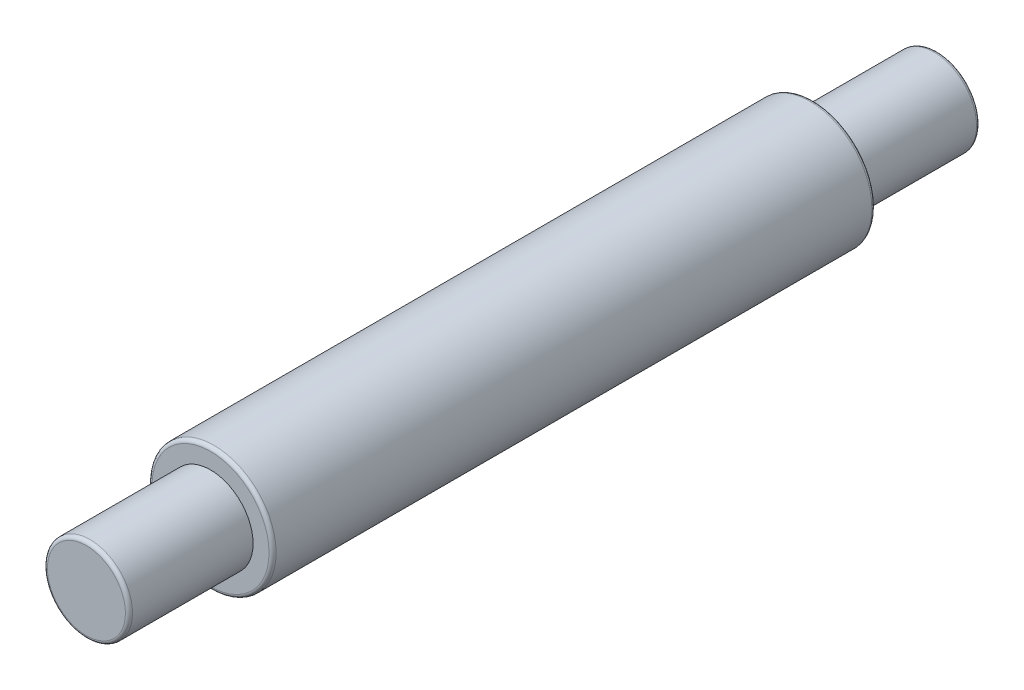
ISO-10303-21;
HEADER;
FILE_DESCRIPTION(('STEP AP214'),'2;1');
FILE_NAME('part.step','',(''),(''),'','','');
FILE_SCHEMA(('AUTOMOTIVE_DESIGN { 1 0 10303 214 1 1 1 1 }'));
ENDSEC;
DATA;
#1=APPLICATION_CONTEXT('core data for automotive mechanical design processes');
#2=APPLICATION_PROTOCOL_DEFINITION('international standard','automotive_design',2000,#1);
#3=PRODUCT_CONTEXT('',#1,'mechanical');
#4=PRODUCT('Part','Part','',(#3));
#5=PRODUCT_RELATED_PRODUCT_CATEGORY('part','',(#4));
#6=PRODUCT_DEFINITION_FORMATION('','',#4);
#7=PRODUCT_DEFINITION_CONTEXT('part definition',#1,'design');
#8=PRODUCT_DEFINITION('design','',#6,#7);
#9=PRODUCT_DEFINITION_SHAPE('','',#8);
#10=(LENGTH_UNIT() NAMED_UNIT(*) SI_UNIT(.MILLI.,.METRE.));
#11=(NAMED_UNIT(*) PLANE_ANGLE_UNIT() SI_UNIT($,.RADIAN.));
#12=(NAMED_UNIT(*) SI_UNIT($,.STERADIAN.) SOLID_ANGLE_UNIT());
#13=UNCERTAINTY_MEASURE_WITH_UNIT(LENGTH_MEASURE(1.E-05),#10,'distance_accuracy_value','');
#14=(GEOMETRIC_REPRESENTATION_CONTEXT(3) GLOBAL_UNCERTAINTY_ASSIGNED_CONTEXT((#13)) GLOBAL_UNIT_ASSIGNED_CONTEXT((#10,
#11,#12)) REPRESENTATION_CONTEXT('',''));
#15=CARTESIAN_POINT('',(0.,0.,0.));
#16=DIRECTION('',(0.,0.,1.));
#17=DIRECTION('',(1.,0.,0.));
#18=AXIS2_PLACEMENT_3D('',#15,#16,#17);
#19=CARTESIAN_POINT('',(0.,0.,120.));
#20=DIRECTION('',(0.,0.,-1.));
#21=DIRECTION('',(-1.,0.,0.));
#22=AXIS2_PLACEMENT_3D('',#19,#20,#21);
#23=CYLINDRICAL_SURFACE('',#22,12.);
#24=CARTESIAN_POINT('',(0.,0.,85.));
#25=DIRECTION('',(0.,0.,1.));
#26=DIRECTION('',(1.,0.,0.));
#27=AXIS2_PLACEMENT_3D('',#24,#25,#26);
#28=CIRCLE('',#27,12.);
#29=CARTESIAN_POINT('',(12.,0.,85.));
#30=VERTEX_POINT('',#29);
#31=EDGE_CURVE('E68',#30,#30,#28,.T.);
#32=ORIENTED_EDGE('',*,*,#31,.T.);
#33=EDGE_LOOP('',(#32));
#34=FACE_BOUND('',#33,.T.);
#35=CARTESIAN_POINT('',(0.,0.,119.));
#36=DIRECTION('',(0.,0.,1.));
#37=DIRECTION('',(1.,0.,0.));
#38=AXIS2_PLACEMENT_3D('',#35,#36,#37);
#39=CIRCLE('',#38,12.);
#40=CARTESIAN_POINT('',(12.,0.,119.));
#41=VERTEX_POINT('',#40);
#42=EDGE_CURVE('E65',#41,#41,#39,.F.);
#43=ORIENTED_EDGE('',*,*,#42,.T.);
#44=EDGE_LOOP('',(#43));
#45=FACE_BOUND('',#44,.T.);
#46=ADVANCED_FACE('F33',(#34,#45),#23,.T.);
#47=CARTESIAN_POINT('',(0.,0.,120.));
#48=DIRECTION('',(0.,0.,1.));
#49=DIRECTION('',(1.,0.,0.));
#50=AXIS2_PLACEMENT_3D('',#47,#48,#49);
#51=PLANE('',#50);
#52=CARTESIAN_POINT('',(0.,0.,120.));
#53=DIRECTION('',(0.,0.,1.));
#54=DIRECTION('',(1.,0.,0.));
#55=AXIS2_PLACEMENT_3D('',#52,#53,#54);
#56=CIRCLE('',#55,11.);
#57=CARTESIAN_POINT('',(11.,0.,120.));
#58=VERTEX_POINT('',#57);
#59=EDGE_CURVE('E56',#58,#58,#56,.T.);
#60=ORIENTED_EDGE('',*,*,#59,.T.);
#61=EDGE_LOOP('',(#60));
#62=FACE_BOUND('',#61,.T.);
#63=ADVANCED_FACE('F85',(#62),#51,.T.);
#64=CARTESIAN_POINT('',(0.,0.,119.));
#65=DIRECTION('',(0.,0.,1.));
#66=DIRECTION('',(1.,0.,0.));
#67=AXIS2_PLACEMENT_3D('',#64,#65,#66);
#68=TOROIDAL_SURFACE('',#67,11.,1.);
#69=ORIENTED_EDGE('',*,*,#42,.F.);
#70=EDGE_LOOP('',(#69));
#71=FACE_BOUND('',#70,.T.);
#72=ORIENTED_EDGE('',*,*,#59,.F.);
#73=EDGE_LOOP('',(#72));
#74=FACE_BOUND('',#73,.T.);
#75=ADVANCED_FACE('F77',(#71,#74),#68,.T.);
#76=CARTESIAN_POINT('',(0.,0.,85.));
#77=DIRECTION('',(0.,0.,1.));
#78=DIRECTION('',(1.,0.,0.));
#79=AXIS2_PLACEMENT_3D('',#76,#77,#78);
#80=PLANE('',#79);
#81=CARTESIAN_POINT('',(0.,0.,85.));
#82=DIRECTION('',(0.,0.,1.));
#83=DIRECTION('',(1.,0.,0.));
#84=AXIS2_PLACEMENT_3D('',#81,#82,#83);
#85=CIRCLE('',#84,16.5);
#86=CARTESIAN_POINT('',(16.5,0.,85.));
#87=VERTEX_POINT('',#86);
#88=EDGE_CURVE('E10',#87,#87,#85,.T.);
#89=ORIENTED_EDGE('',*,*,#88,.T.);
#90=EDGE_LOOP('',(#89));
#91=FACE_BOUND('',#90,.T.);
#92=ORIENTED_EDGE('',*,*,#31,.F.);
#93=EDGE_LOOP('',(#92));
#94=FACE_BOUND('',#93,.T.);
#95=ADVANCED_FACE('F74',(#91,#94),#80,.T.);
#96=CARTESIAN_POINT('',(0.,0.,-85.));
#97=DIRECTION('',(0.,0.,1.));
#98=DIRECTION('',(1.,0.,0.));
#99=AXIS2_PLACEMENT_3D('',#96,#97,#98);
#100=PLANE('',#99);
#101=CARTESIAN_POINT('',(0.,0.,-85.));
#102=DIRECTION('',(0.,0.,1.));
#103=DIRECTION('',(1.,0.,0.));
#104=AXIS2_PLACEMENT_3D('',#101,#102,#103);
#105=CIRCLE('',#104,16.5);
#106=CARTESIAN_POINT('',(16.5,0.,-85.));
#107=VERTEX_POINT('',#106);
#108=EDGE_CURVE('E40',#107,#107,#105,.F.);
#109=ORIENTED_EDGE('',*,*,#108,.T.);
#110=EDGE_LOOP('',(#109));
#111=FACE_BOUND('',#110,.T.);
#112=CARTESIAN_POINT('',(0.,0.,-85.));
#113=DIRECTION('',(0.,0.,1.));
#114=DIRECTION('',(1.,0.,0.));
#115=AXIS2_PLACEMENT_3D('',#112,#113,#114);
#116=CIRCLE('',#115,12.);
#117=CARTESIAN_POINT('',(12.,0.,-85.));
#118=VERTEX_POINT('',#117);
#119=EDGE_CURVE('E53',#118,#118,#116,.T.);
#120=ORIENTED_EDGE('',*,*,#119,.T.);
#121=EDGE_LOOP('',(#120));
#122=FACE_BOUND('',#121,.T.);
#123=ADVANCED_FACE('F76',(#111,#122),#100,.F.);
#124=CARTESIAN_POINT('',(0.,0.,85.));
#125=DIRECTION('',(0.,0.,-1.));
#126=DIRECTION('',(-1.,0.,0.));
#127=AXIS2_PLACEMENT_3D('',#124,#125,#126);
#128=CYLINDRICAL_SURFACE('',#127,17.5);
#129=CARTESIAN_POINT('',(0.,0.,-84.));
#130=DIRECTION('',(0.,0.,1.));
#131=DIRECTION('',(1.,0.,0.));
#132=AXIS2_PLACEMENT_3D('',#129,#130,#131);
#133=CIRCLE('',#132,17.5);
#134=CARTESIAN_POINT('',(17.5,0.,-84.));
#135=VERTEX_POINT('',#134);
#136=EDGE_CURVE('E44',#135,#135,#133,.T.);
#137=ORIENTED_EDGE('',*,*,#136,.T.);
#138=EDGE_LOOP('',(#137));
#139=FACE_BOUND('',#138,.T.);
#140=CARTESIAN_POINT('',(0.,0.,84.));
#141=DIRECTION('',(0.,0.,1.));
#142=DIRECTION('',(1.,0.,0.));
#143=AXIS2_PLACEMENT_3D('',#140,#141,#142);
#144=CIRCLE('',#143,17.5);
#145=CARTESIAN_POINT('',(17.5,0.,84.));
#146=VERTEX_POINT('',#145);
#147=EDGE_CURVE('E48',#146,#146,#144,.F.);
#148=ORIENTED_EDGE('',*,*,#147,.T.);
#149=EDGE_LOOP('',(#148));
#150=FACE_BOUND('',#149,.T.);
#151=ADVANCED_FACE('F83',(#139,#150),#128,.T.);
#152=CARTESIAN_POINT('',(0.,0.,-120.));
#153=DIRECTION('',(0.,0.,1.));
#154=DIRECTION('',(1.,0.,0.));
#155=AXIS2_PLACEMENT_3D('',#152,#153,#154);
#156=PLANE('',#155);
#157=CARTESIAN_POINT('',(0.,0.,-120.));
#158=DIRECTION('',(0.,0.,1.));
#159=DIRECTION('',(1.,0.,0.));
#160=AXIS2_PLACEMENT_3D('',#157,#158,#159);
#161=CIRCLE('',#160,11.);
#162=CARTESIAN_POINT('',(11.,0.,-120.));
#163=VERTEX_POINT('',#162);
#164=EDGE_CURVE('E59',#163,#163,#161,.F.);
#165=ORIENTED_EDGE('',*,*,#164,.T.);
#166=EDGE_LOOP('',(#165));
#167=FACE_BOUND('',#166,.T.);
#168=ADVANCED_FACE('F107',(#167),#156,.F.);
#169=CARTESIAN_POINT('',(0.,0.,-119.));
#170=DIRECTION('',(0.,0.,1.));
#171=DIRECTION('',(1.,0.,0.));
#172=AXIS2_PLACEMENT_3D('',#169,#170,#171);
#173=TOROIDAL_SURFACE('',#172,11.,1.);
#174=ORIENTED_EDGE('',*,*,#164,.F.);
#175=EDGE_LOOP('',(#174));
#176=FACE_BOUND('',#175,.T.);
#177=CARTESIAN_POINT('',(0.,0.,-119.));
#178=DIRECTION('',(0.,0.,1.));
#179=DIRECTION('',(1.,0.,0.));
#180=AXIS2_PLACEMENT_3D('',#177,#178,#179);
#181=CIRCLE('',#180,12.);
#182=CARTESIAN_POINT('',(12.,0.,-119.));
#183=VERTEX_POINT('',#182);
#184=EDGE_CURVE('E62',#183,#183,#181,.T.);
#185=ORIENTED_EDGE('',*,*,#184,.F.);
#186=EDGE_LOOP('',(#185));
#187=FACE_BOUND('',#186,.T.);
#188=ADVANCED_FACE('F100',(#176,#187),#173,.T.);
#189=ORIENTED_EDGE('',*,*,#184,.T.);
#190=EDGE_LOOP('',(#189));
#191=FACE_BOUND('',#190,.T.);
#192=ORIENTED_EDGE('',*,*,#119,.F.);
#193=EDGE_LOOP('',(#192));
#194=FACE_BOUND('',#193,.T.);
#195=ADVANCED_FACE('F90',(#191,#194),#23,.T.);
#196=CARTESIAN_POINT('',(0.,0.,-84.));
#197=DIRECTION('',(0.,0.,1.));
#198=DIRECTION('',(1.,0.,0.));
#199=AXIS2_PLACEMENT_3D('',#196,#197,#198);
#200=TOROIDAL_SURFACE('',#199,16.5,1.);
#201=ORIENTED_EDGE('',*,*,#108,.F.);
#202=EDGE_LOOP('',(#201));
#203=FACE_BOUND('',#202,.T.);
#204=ORIENTED_EDGE('',*,*,#136,.F.);
#205=EDGE_LOOP('',(#204));
#206=FACE_BOUND('',#205,.T.);
#207=ADVANCED_FACE('F99',(#203,#206),#200,.T.);
#208=CARTESIAN_POINT('',(0.,0.,84.));
#209=DIRECTION('',(0.,0.,1.));
#210=DIRECTION('',(1.,0.,0.));
#211=AXIS2_PLACEMENT_3D('',#208,#209,#210);
#212=TOROIDAL_SURFACE('',#211,16.5,1.);
#213=ORIENTED_EDGE('',*,*,#147,.F.);
#214=EDGE_LOOP('',(#213));
#215=FACE_BOUND('',#214,.T.);
#216=ORIENTED_EDGE('',*,*,#88,.F.);
#217=EDGE_LOOP('',(#216));
#218=FACE_BOUND('',#217,.T.);
#219=ADVANCED_FACE('F35',(#215,#218),#212,.T.);
#220=CLOSED_SHELL('',(#46,#63,#75,#95,#123,#151,#168,#188,#195,#207,#219));
#221=MANIFOLD_SOLID_BREP('B2',#220);
#222=ADVANCED_BREP_SHAPE_REPRESENTATION('',(#18,#221),#14);
#223=SHAPE_DEFINITION_REPRESENTATION(#9,#222);
ENDSEC;
END-ISO-10303-21;
